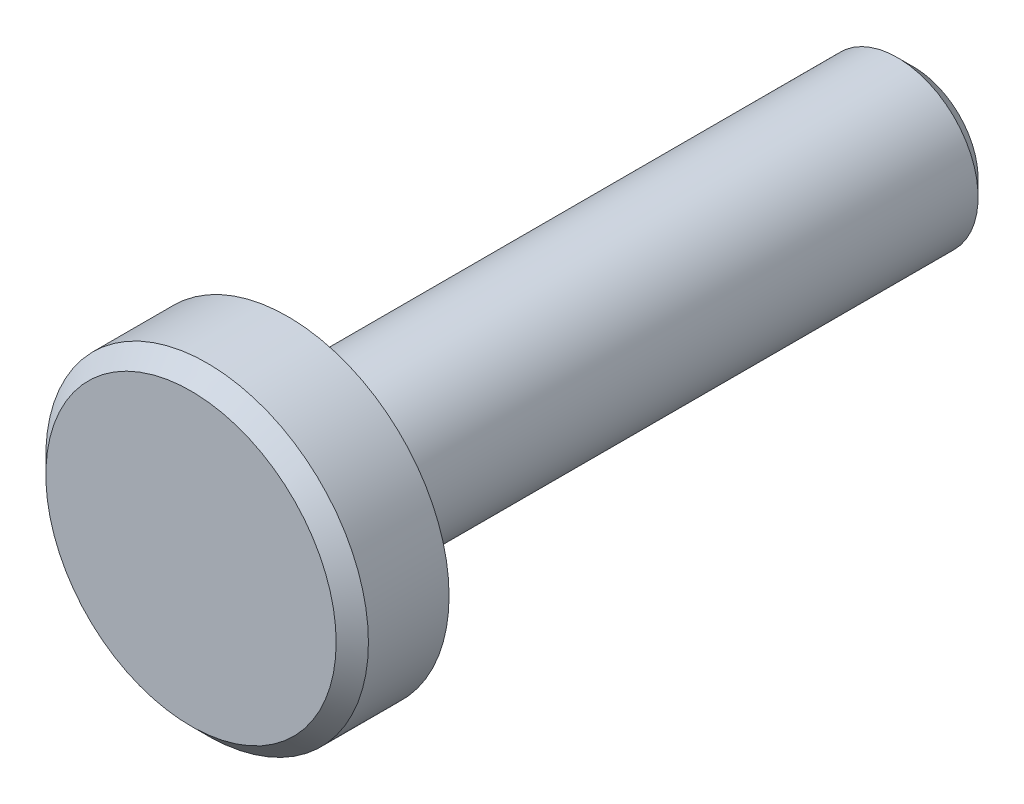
from build123d import *

# Parameters (mm, degrees)
BASE_EXTRUSION_DEPTH      = 5.7
BASE_EXTRUSION_DEPTH_BACK = 4
ESQUISSE1_R               = 1.25
ESQUISSE2_R               = 2.5
BOSS_EXTRU_1_DEPTH        = 1.5
CHANFREIN1_SIZE           = 0.25


with BuildPart() as part:
    # Esquisse1 → Base-Extrusion (new, two sides: drawn at the far end of the back side and taken through both)
    with BuildSketch(Plane.XY.offset(-BASE_EXTRUSION_DEPTH_BACK)):
        with Locations(Location((-14.011033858, -19.5, 0), (0, 0, 180))):
            Circle(ESQUISSE1_R)
    extrude(amount=BASE_EXTRUSION_DEPTH + BASE_EXTRUSION_DEPTH_BACK)

    # Esquisse2 → Boss.-Extru.1 (add)
    with BuildSketch(Plane.XY.offset(5.7)):
        with Locations((-14.011033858, -19.5)):
            Circle(ESQUISSE2_R)
    extrude(amount=BOSS_EXTRU_1_DEPTH)

    # Chanfrein1
    chanfrein1_edges = [part.edges().sort_by_distance(p)[0] for p in [
        (-16.511033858, -19.5, 7.2),
        (-12.761033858, -19.5, -4),
    ]]
    chamfer(chanfrein1_edges, length=CHANFREIN1_SIZE)


solid = part.part
